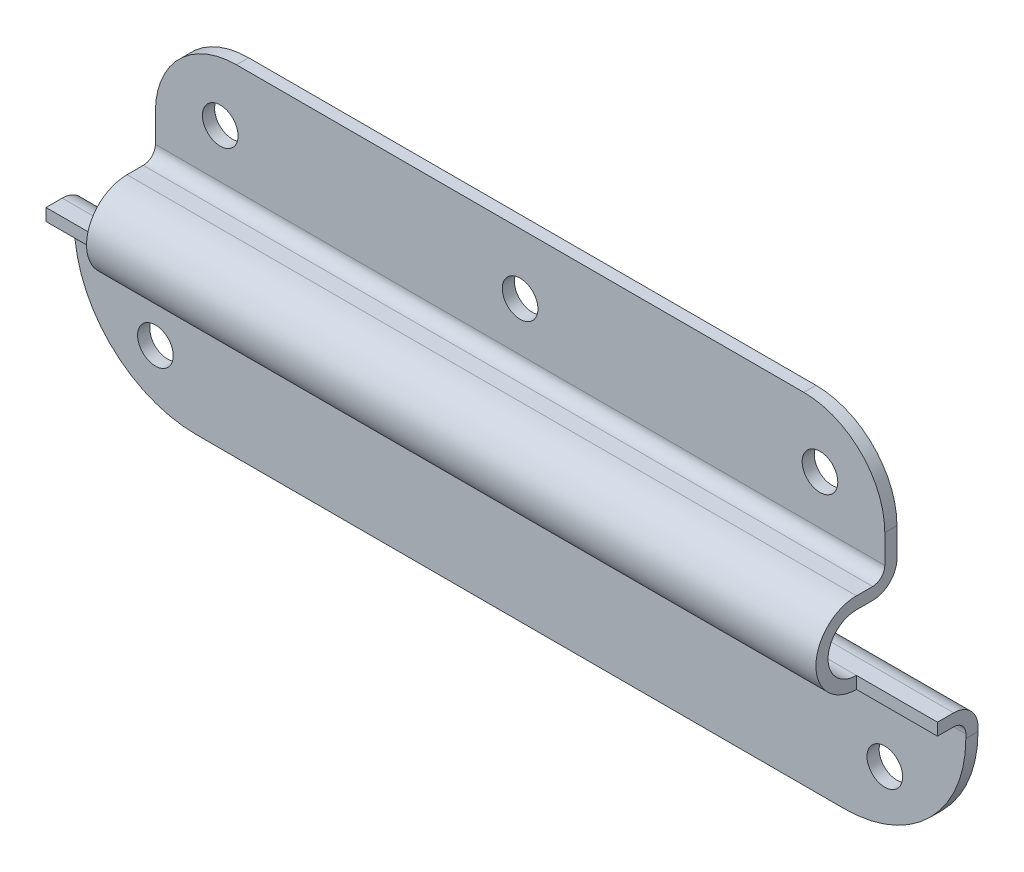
from build123d import *

# Parameters (mm, degrees)
BOSS_EXTRUDE1_DEPTH = 55
SKETCH2_R           = 2.2
CUT_EXTRUDE1_DEPTH  = 60.447455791
SKETCH3_W           = 10
SKETCH3_H           = 10
CUT_EXTRUDE2_DEPTH  = 60.447455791


with BuildPart() as part:
    # Sketch1 → Boss-Extrude1 (new, symmetric)
    with BuildSketch(Plane(origin=(0, 0, 0), x_dir=(0, 0, -1), z_dir=(1, 0, 0))):
        with BuildLine():
            Line((3.5, 20), (3.5, 6.5))
            ThreePointArc((3.5, 6.5), (3.060660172, 5.439339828), (2, 5))
            Line((2, 5), (0, 5))
            ThreePointArc((0, 5), (-5, 0), (0, -5))
            Line((0, -5), (2, -5))
            ThreePointArc((2, -5), (3.060660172, -5.439339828), (3.5, -6.5))
            Line((3.5, -6.5), (3.5, -22))
            Line((3.5, -22), (5, -22))
            Line((5, -22), (5, -6.5))
            ThreePointArc((5, -6.5), (4.121320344, -4.378679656), (2, -3.5))
            Line((2, -3.5), (0, -3.5))
            ThreePointArc((0, -3.5), (-3.5, 0), (0, 3.5))
            Line((0, 3.5), (2, 3.5))
            ThreePointArc((2, 3.5), (4.121320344, 4.378679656), (5, 6.5))
            Line((5, 6.5), (5, 20))
            Line((5, 20), (3.5, 20))
        make_face()
    extrude(amount=BOSS_EXTRUDE1_DEPTH, both=True)

    # Sketch2 → Cut-Extrude1 (cut, through all)
    with BuildSketch(Plane.XY):
        with Locations((37, 12.5)):
            Circle(SKETCH2_R)
        with Locations((0, 12.5)):
            Circle(SKETCH2_R)
        with Locations((-37, 12.5)):
            Circle(SKETCH2_R)
        with Locations((-45, -15)):
            Circle(SKETCH2_R)
        with Locations((45, -15)):
            Circle(SKETCH2_R)
        with BuildLine():
            Line((45, 10), (45, 0))
            Line((45, 0), (55, 0))
            Line((55, 0), (55, 20))
            Line((55, 20), (35, 20))
            ThreePointArc((35, 20), (42.071067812, 17.071067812), (45, 10))
        make_face()
        with BuildLine():
            Line((-45, 10), (-45, 0))
            Line((-45, 0), (-55, 0))
            Line((-55, 0), (-55, 20))
            Line((-55, 20), (-35, 20))
            ThreePointArc((-35, 20), (-42.071067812, 17.071067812), (-45, 10))
        make_face()
        with BuildLine():
            Line((55, -22), (55, -7))
            ThreePointArc((55, -7), (50.606601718, -17.606601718), (40, -22))
            Line((40, -22), (55, -22))
        make_face()
        with BuildLine():
            Line((-55, -7), (-55, -22))
            Line((-55, -22), (-40, -22))
            ThreePointArc((-40, -22), (-50.606601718, -17.606601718), (-55, -7))
        make_face()
    extrude(amount=-CUT_EXTRUDE1_DEPTH, mode=Mode.SUBTRACT)

    # Sketch3 → Cut-Extrude2 (cut, through all)
    with BuildSketch(Plane(origin=(0, 0, 0), x_dir=(-1, 0, 0), z_dir=(0, 0, -1))):
        with Locations((50, 0)):
            Rectangle(SKETCH3_W, SKETCH3_H)
        with Locations((-50, 0)):
            Rectangle(SKETCH3_W, SKETCH3_H)
    extrude(amount=-CUT_EXTRUDE2_DEPTH, mode=Mode.SUBTRACT)


solid = part.part
